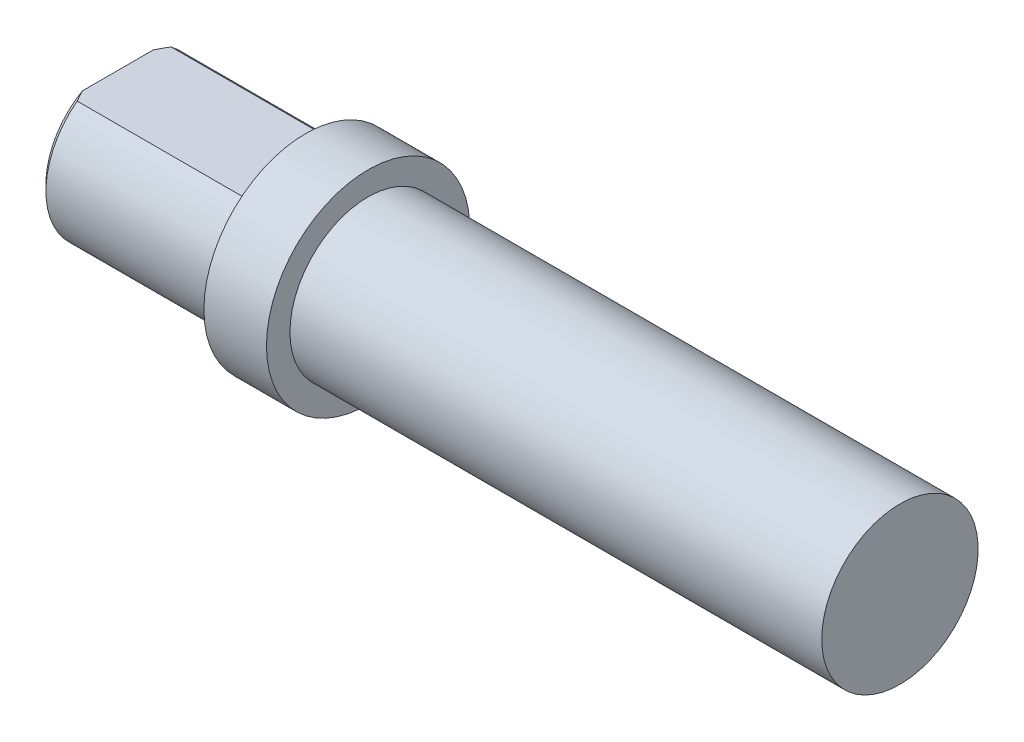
from build123d import *

# Parameters (mm, degrees)
ESQUISSE1_W             = 25
ESQUISSE1_H             = 2.5
ENL_V_MAT_EXTRU_1_DEPTH = 8
CHANFREIN1_SIZE         = 0.2
ESQUISSE3_R             = 3.25
BOSS_EXTRU_1_DEPTH      = 2


with BuildPart() as part:
    # Esquisse1 → R_volution1 (revolve)
    with BuildSketch(Plane.XY, mode=Mode.PRIVATE) as r_volution1_sk:
        with Locations((-12.5, 1.25)):
            Rectangle(ESQUISSE1_W, ESQUISSE1_H)
    revolve(r_volution1_sk.sketch.rotate(Axis((0, 0, 0), (1, 0, 0)), 90), axis=Axis((0, 0, 0), (1, 0, 0)))

    # Esquisse2 → Enl_v. mat.-Extru.1 (cut)
    with BuildSketch(Plane.ZY.offset(25)):
        with BuildLine():
            Line((-1.5, 2), (0, 2))
            Line((0, 2), (1.5, 2))
            ThreePointArc((1.5, 2), (0, 2.5), (-1.5, 2))
        make_face()
    extrude(amount=-ENL_V_MAT_EXTRU_1_DEPTH, mode=Mode.SUBTRACT)

    # Chanfrein1
    chanfrein1_edges = [part.edges().sort_by_distance(p)[0] for p in [
        (-25, -2.236067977, -1.118033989),
    ]]
    chamfer(chanfrein1_edges, length=CHANFREIN1_SIZE)

    # Esquisse3 → Boss.-Extru.1 (add)
    with BuildSketch(Plane.ZY.offset(17)):
        Circle(ESQUISSE3_R)
    extrude(amount=BOSS_EXTRU_1_DEPTH)


solid = part.part
